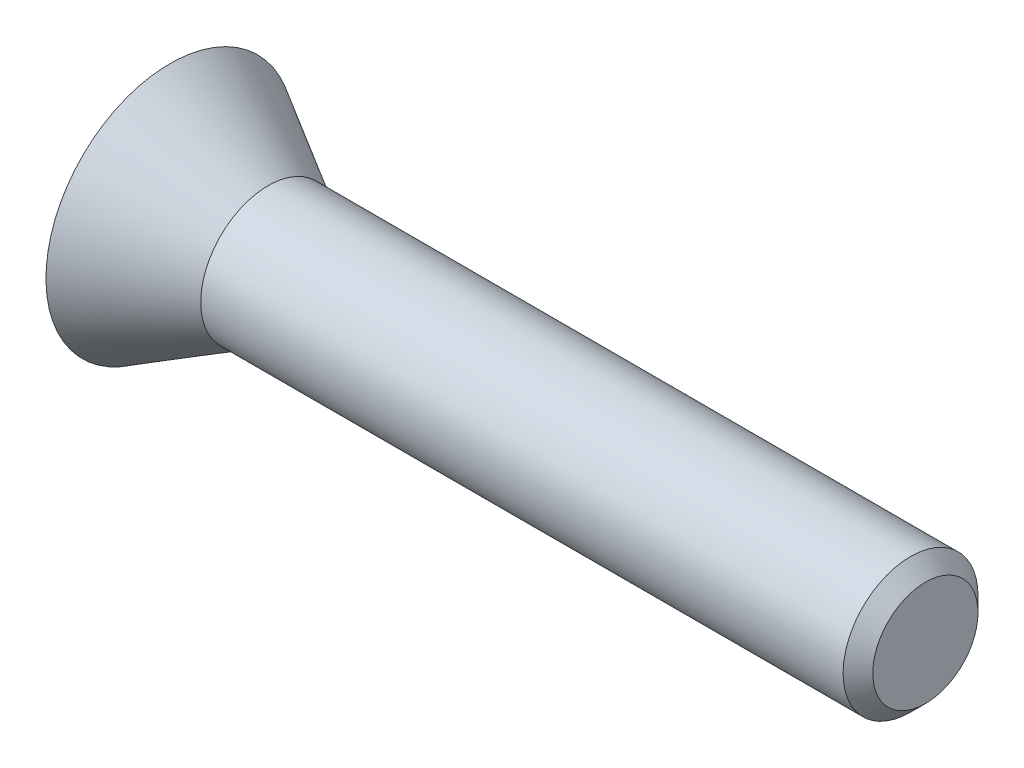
ISO-10303-21;
HEADER;
FILE_DESCRIPTION(('STEP AP214'),'2;1');
FILE_NAME('part.step','',(''),(''),'','','');
FILE_SCHEMA(('AUTOMOTIVE_DESIGN { 1 0 10303 214 1 1 1 1 }'));
ENDSEC;
DATA;
#1=APPLICATION_CONTEXT('core data for automotive mechanical design processes');
#2=APPLICATION_PROTOCOL_DEFINITION('international standard','automotive_design',2000,#1);
#3=PRODUCT_CONTEXT('',#1,'mechanical');
#4=PRODUCT('Part','Part','',(#3));
#5=PRODUCT_RELATED_PRODUCT_CATEGORY('part','',(#4));
#6=PRODUCT_DEFINITION_FORMATION('','',#4);
#7=PRODUCT_DEFINITION_CONTEXT('part definition',#1,'design');
#8=PRODUCT_DEFINITION('design','',#6,#7);
#9=PRODUCT_DEFINITION_SHAPE('','',#8);
#10=(LENGTH_UNIT() NAMED_UNIT(*) SI_UNIT(.MILLI.,.METRE.));
#11=(NAMED_UNIT(*) PLANE_ANGLE_UNIT() SI_UNIT($,.RADIAN.));
#12=(NAMED_UNIT(*) SI_UNIT($,.STERADIAN.) SOLID_ANGLE_UNIT());
#13=UNCERTAINTY_MEASURE_WITH_UNIT(LENGTH_MEASURE(1.E-05),#10,'distance_accuracy_value','');
#14=(GEOMETRIC_REPRESENTATION_CONTEXT(3) GLOBAL_UNCERTAINTY_ASSIGNED_CONTEXT((#13)) GLOBAL_UNIT_ASSIGNED_CONTEXT((#10,
#11,#12)) REPRESENTATION_CONTEXT('',''));
#15=CARTESIAN_POINT('',(0.,0.,0.));
#16=DIRECTION('',(0.,0.,1.));
#17=DIRECTION('',(1.,0.,0.));
#18=AXIS2_PLACEMENT_3D('',#15,#16,#17);
#19=CARTESIAN_POINT('',(-7.,0.,0.));
#20=DIRECTION('',(1.,0.,0.));
#21=DIRECTION('',(0.,0.,-1.));
#22=AXIS2_PLACEMENT_3D('',#19,#20,#21);
#23=PLANE('',#22);
#24=CARTESIAN_POINT('',(-7.,-0.814550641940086,-1.03166904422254));
#25=CARTESIAN_POINT('',(-7.,-0.814409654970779,-1.01863491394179));
#26=CARTESIAN_POINT('',(-7.,-0.81413144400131,-0.992914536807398));
#27=CARTESIAN_POINT('',(-7.,-0.811236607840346,-0.955094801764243));
#28=CARTESIAN_POINT('',(-7.,-0.806397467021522,-0.918608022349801));
#29=CARTESIAN_POINT('',(-7.,-0.799573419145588,-0.88365317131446));
#30=CARTESIAN_POINT('',(-7.,-0.790964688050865,-0.8501336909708));
#31=CARTESIAN_POINT('',(-7.,-0.780789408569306,-0.817906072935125));
#32=CARTESIAN_POINT('',(-7.,-0.768192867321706,-0.787280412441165));
#33=CARTESIAN_POINT('',(-7.,-0.753908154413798,-0.757959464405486));
#34=CARTESIAN_POINT('',(-7.,-0.737740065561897,-0.730356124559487));
#35=CARTESIAN_POINT('',(-7.,-0.719554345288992,-0.704528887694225));
#36=CARTESIAN_POINT('',(-7.,-0.699921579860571,-0.680221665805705));
#37=CARTESIAN_POINT('',(-7.,-0.678448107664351,-0.657618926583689));
#38=CARTESIAN_POINT('',(-7.,-0.65525940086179,-0.636744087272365));
#39=CARTESIAN_POINT('',(-7.,-0.630329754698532,-0.617478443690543));
#40=CARTESIAN_POINT('',(-7.,-0.603500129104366,-0.600217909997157));
#41=CARTESIAN_POINT('',(-7.,-0.575132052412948,-0.584427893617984));
#42=CARTESIAN_POINT('',(-7.,-0.545147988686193,-0.57037959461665));
#43=CARTESIAN_POINT('',(-7.,-0.513404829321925,-0.558522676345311));
#44=CARTESIAN_POINT('',(-7.,-0.480253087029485,-0.54824282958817));
#45=CARTESIAN_POINT('',(-7.,-0.445698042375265,-0.539643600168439));
#46=CARTESIAN_POINT('',(-7.,-0.409582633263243,-0.533059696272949));
#47=CARTESIAN_POINT('',(-7.,-0.371934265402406,-0.528671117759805));
#48=CARTESIAN_POINT('',(-7.,-0.332717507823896,-0.525628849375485));
#49=CARTESIAN_POINT('',(-7.,-0.306045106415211,-0.525377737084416));
#50=CARTESIAN_POINT('',(-7.,-0.29243937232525,-0.525249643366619));
#51=B_SPLINE_CURVE_WITH_KNOTS('',3,(#24,#25,#26,#27,#28,#29,#30,#31,#32,#33,#34,#35,#36,#37,#38,
#39,#40,#41,#42,#43,#44,#45,#46,#47,#48,#49,#50),.UNSPECIFIED.,.F.,.F.,(4,1,1,1,1,1,1,1,1,1,1,1,
1,1,1,1,1,1,1,1,1,1,1,1,4),(0.,0.04725989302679,0.093258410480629,0.137448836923,
0.180669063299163,0.222325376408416,0.262898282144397,0.303117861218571,0.342294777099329,
0.381096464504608,0.418984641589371,0.456742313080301,0.494310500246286,0.531916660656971,
0.569787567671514,0.608434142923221,0.647492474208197,0.687453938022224,0.728384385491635,
0.770272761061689,0.813266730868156,0.85743965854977,0.903297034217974,0.950671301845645,1.),.UNSPECIFIED.);
#52=CARTESIAN_POINT('',(-7.,-0.814550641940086,-1.03166904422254));
#53=VERTEX_POINT('',#52);
#54=CARTESIAN_POINT('',(-7.,-0.29243937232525,-0.525249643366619));
#55=VERTEX_POINT('',#54);
#56=EDGE_CURVE('E255',#53,#55,#51,.T.);
#57=ORIENTED_EDGE('',*,*,#56,.F.);
#58=CARTESIAN_POINT('',(-7.,-0.33095577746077,-1.53323823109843));
#59=CARTESIAN_POINT('',(-7.,-0.355694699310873,-1.52836228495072));
#60=CARTESIAN_POINT('',(-7.,-0.403791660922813,-1.51888255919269));
#61=CARTESIAN_POINT('',(-7.,-0.47228513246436,-1.49757997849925));
#62=CARTESIAN_POINT('',(-7.,-0.535215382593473,-1.4713282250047));
#63=CARTESIAN_POINT('',(-7.,-0.592488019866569,-1.44008717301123));
#64=CARTESIAN_POINT('',(-7.,-0.6435367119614,-1.40366636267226));
#65=CARTESIAN_POINT('',(-7.,-0.688552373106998,-1.36293722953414));
#66=CARTESIAN_POINT('',(-7.,-0.727155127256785,-1.31755558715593));
#67=CARTESIAN_POINT('',(-7.,-0.75895707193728,-1.26761478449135));
#68=CARTESIAN_POINT('',(-7.,-0.783958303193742,-1.21369041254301));
#69=CARTESIAN_POINT('',(-7.,-0.801516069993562,-1.15607758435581));
#70=CARTESIAN_POINT('',(-7.,-0.812875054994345,-1.09507319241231));
#71=CARTESIAN_POINT('',(-7.,-0.813983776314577,-1.05311921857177));
#72=CARTESIAN_POINT('',(-7.,-0.814550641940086,-1.03166904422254));
#73=B_SPLINE_CURVE_WITH_KNOTS('',3,(#58,#59,#60,#61,#62,#63,#64,#65,#66,#67,#68,#69,#70,#71,
#72),.UNSPECIFIED.,.F.,.F.,(4,1,1,1,1,1,1,1,1,1,1,1,4),(0.,0.0988237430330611,0.192131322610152,
0.28071953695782,0.365844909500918,0.447392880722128,0.52606487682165,0.603327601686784,
0.680299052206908,0.757555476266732,0.835645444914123,0.915969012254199,1.),.UNSPECIFIED.);
#74=CARTESIAN_POINT('',(-7.,-0.33095577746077,-1.53323823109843));
#75=VERTEX_POINT('',#74);
#76=EDGE_CURVE('E49',#75,#53,#73,.T.);
#77=ORIENTED_EDGE('',*,*,#76,.F.);
#78=DIRECTION('',(0.,0.,-1.));
#79=VECTOR('',#78,1.);
#80=CARTESIAN_POINT('',(-7.,-0.33095577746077,-1.25991440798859));
#81=LINE('',#80,#79);
#82=CARTESIAN_POINT('',(-7.,-0.33095577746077,-1.25991440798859));
#83=VERTEX_POINT('',#82);
#84=EDGE_CURVE('E186',#83,#75,#81,.T.);
#85=ORIENTED_EDGE('',*,*,#84,.F.);
#86=CARTESIAN_POINT('',(-7.,-0.550641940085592,-1.03166904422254));
#87=CARTESIAN_POINT('',(-7.,-0.550270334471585,-1.0410991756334));
#88=CARTESIAN_POINT('',(-7.,-0.549541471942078,-1.05959531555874));
#89=CARTESIAN_POINT('',(-7.,-0.54507953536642,-1.08661629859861));
#90=CARTESIAN_POINT('',(-7.,-0.536856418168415,-1.11205742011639));
#91=CARTESIAN_POINT('',(-7.,-0.525776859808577,-1.13609037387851));
#92=CARTESIAN_POINT('',(-7.,-0.511462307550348,-1.15853899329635));
#93=CARTESIAN_POINT('',(-7.,-0.493775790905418,-1.178763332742));
#94=CARTESIAN_POINT('',(-7.,-0.47364330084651,-1.19760112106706));
#95=CARTESIAN_POINT('',(-7.,-0.450409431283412,-1.21436735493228));
#96=CARTESIAN_POINT('',(-7.,-0.42440946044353,-1.22922997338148));
#97=CARTESIAN_POINT('',(-7.,-0.395633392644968,-1.24165925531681));
#98=CARTESIAN_POINT('',(-7.,-0.364401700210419,-1.25244828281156));
#99=CARTESIAN_POINT('',(-7.,-0.342332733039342,-1.25737473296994));
#100=CARTESIAN_POINT('',(-7.,-0.33095577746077,-1.25991440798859));
#101=B_SPLINE_CURVE_WITH_KNOTS('',3,(#86,#87,#88,#89,#90,#91,#92,#93,#94,#95,#96,#97,#98,#99,
#100),.UNSPECIFIED.,.F.,.F.,(4,1,1,1,1,1,1,1,1,1,1,1,4),(0.,0.0817564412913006,
0.160356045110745,0.236478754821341,0.312819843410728,0.389192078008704,0.466352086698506,
0.545094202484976,0.627698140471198,0.714093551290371,0.80415108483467,0.89903630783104,1.),.UNSPECIFIED.);
#102=CARTESIAN_POINT('',(-7.,-0.550641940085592,-1.03166904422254));
#103=VERTEX_POINT('',#102);
#104=EDGE_CURVE('E189',#103,#83,#101,.T.);
#105=ORIENTED_EDGE('',*,*,#104,.F.);
#106=CARTESIAN_POINT('',(-7.,-0.29243937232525,-0.798573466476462));
#107=CARTESIAN_POINT('',(-7.,-0.30558072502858,-0.798881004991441));
#108=CARTESIAN_POINT('',(-7.,-0.331019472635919,-0.799476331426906));
#109=CARTESIAN_POINT('',(-7.,-0.367667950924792,-0.804633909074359));
#110=CARTESIAN_POINT('',(-7.,-0.401378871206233,-0.813166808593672));
#111=CARTESIAN_POINT('',(-7.,-0.432094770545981,-0.825005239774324));
#112=CARTESIAN_POINT('',(-7.,-0.459377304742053,-0.840555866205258));
#113=CARTESIAN_POINT('',(-7.,-0.483446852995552,-0.8590233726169));
#114=CARTESIAN_POINT('',(-7.,-0.504245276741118,-0.88051445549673));
#115=CARTESIAN_POINT('',(-7.,-0.521167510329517,-0.905362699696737));
#116=CARTESIAN_POINT('',(-7.,-0.534404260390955,-0.933082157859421));
#117=CARTESIAN_POINT('',(-7.,-0.543708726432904,-0.963566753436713));
#118=CARTESIAN_POINT('',(-7.,-0.54954934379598,-0.996735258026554));
#119=CARTESIAN_POINT('',(-7.,-0.550269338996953,-1.01975579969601));
#120=CARTESIAN_POINT('',(-7.,-0.550641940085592,-1.03166904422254));
#121=B_SPLINE_CURVE_WITH_KNOTS('',3,(#106,#107,#108,#109,#110,#111,#112,#113,#114,#115,#116,
#117,#118,#119,#120),.UNSPECIFIED.,.F.,.F.,(4,1,1,1,1,1,1,1,1,1,1,1,4),(0.,0.0997433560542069,
0.193081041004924,0.28029932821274,0.363302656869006,0.442209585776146,0.517891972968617,
0.592965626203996,0.668275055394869,0.745143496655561,0.825309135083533,0.909596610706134,1.),.UNSPECIFIED.);
#122=CARTESIAN_POINT('',(-7.,-0.29243937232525,-0.798573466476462));
#123=VERTEX_POINT('',#122);
#124=EDGE_CURVE('E348',#123,#103,#121,.T.);
#125=ORIENTED_EDGE('',*,*,#124,.F.);
#126=DIRECTION('',(0.,-1.,0.));
#127=VECTOR('',#126,1.);
#128=CARTESIAN_POINT('',(-7.,0.0915834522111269,-0.798573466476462));
#129=LINE('',#128,#127);
#130=CARTESIAN_POINT('',(-7.,0.091583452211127,-0.798573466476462));
#131=VERTEX_POINT('',#130);
#132=EDGE_CURVE('E356',#131,#123,#129,.T.);
#133=ORIENTED_EDGE('',*,*,#132,.F.);
#134=CARTESIAN_POINT('',(-7.,0.350641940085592,-1.03166904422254));
#135=CARTESIAN_POINT('',(-7.,0.350225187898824,-1.01976468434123));
#136=CARTESIAN_POINT('',(-7.,0.349420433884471,-0.996777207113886));
#137=CARTESIAN_POINT('',(-7.,0.344177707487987,-0.963475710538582));
#138=CARTESIAN_POINT('',(-7.,0.334301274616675,-0.933141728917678));
#139=CARTESIAN_POINT('',(-7.,0.321199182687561,-0.905351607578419));
#140=CARTESIAN_POINT('',(-7.,0.304229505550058,-0.880526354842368));
#141=CARTESIAN_POINT('',(-7.,0.283426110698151,-0.858932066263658));
#142=CARTESIAN_POINT('',(-7.,0.259071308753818,-0.840557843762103));
#143=CARTESIAN_POINT('',(-7.,0.231584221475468,-0.825074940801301));
#144=CARTESIAN_POINT('',(-7.,0.200731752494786,-0.813103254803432));
#145=CARTESIAN_POINT('',(-7.,0.16689455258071,-0.80467981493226));
#146=CARTESIAN_POINT('',(-7.,0.130166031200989,-0.799467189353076));
#147=CARTESIAN_POINT('',(-7.,0.104725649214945,-0.798877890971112));
#148=CARTESIAN_POINT('',(-7.,0.091583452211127,-0.798573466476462));
#149=B_SPLINE_CURVE_WITH_KNOTS('',3,(#134,#135,#136,#137,#138,#139,#140,#141,#142,#143,#144,
#145,#146,#147,#148),.UNSPECIFIED.,.F.,.F.,(4,1,1,1,1,1,1,1,1,1,1,1,4),(0.,0.0902231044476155,
0.174222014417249,0.25444494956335,0.331160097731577,0.406319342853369,0.481243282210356,
0.557346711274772,0.636723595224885,0.719561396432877,0.807304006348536,0.900455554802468,1.),.UNSPECIFIED.);
#150=CARTESIAN_POINT('',(-7.,0.350641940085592,-1.03166904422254));
#151=VERTEX_POINT('',#150);
#152=EDGE_CURVE('E362',#151,#131,#149,.T.);
#153=ORIENTED_EDGE('',*,*,#152,.F.);
#154=CARTESIAN_POINT('',(-7.,0.131241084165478,-1.25991440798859));
#155=CARTESIAN_POINT('',(-7.,0.142424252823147,-1.25715743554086));
#156=CARTESIAN_POINT('',(-7.,0.164185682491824,-1.25179261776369));
#157=CARTESIAN_POINT('',(-7.,0.195143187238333,-1.24074684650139));
#158=CARTESIAN_POINT('',(-7.,0.223818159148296,-1.22818670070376));
#159=CARTESIAN_POINT('',(-7.,0.24952741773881,-1.21282567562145));
#160=CARTESIAN_POINT('',(-7.,0.272891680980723,-1.19610347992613));
#161=CARTESIAN_POINT('',(-7.,0.293133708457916,-1.17724471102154));
#162=CARTESIAN_POINT('',(-7.,0.310589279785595,-1.15666214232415));
#163=CARTESIAN_POINT('',(-7.,0.325026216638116,-1.13451470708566));
#164=CARTESIAN_POINT('',(-7.,0.336792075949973,-1.11086271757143));
#165=CARTESIAN_POINT('',(-7.,0.344578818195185,-1.08559852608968));
#166=CARTESIAN_POINT('',(-7.,0.349663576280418,-1.05907090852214));
#167=CARTESIAN_POINT('',(-7.,0.350311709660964,-1.04091808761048));
#168=CARTESIAN_POINT('',(-7.,0.350641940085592,-1.03166904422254));
#169=B_SPLINE_CURVE_WITH_KNOTS('',3,(#154,#155,#156,#157,#158,#159,#160,#161,#162,#163,#164,
#165,#166,#167,#168),.UNSPECIFIED.,.F.,.F.,(4,1,1,1,1,1,1,1,1,1,1,1,4),(0.,0.100258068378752,
0.195093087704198,0.285925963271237,0.37244127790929,0.455447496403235,0.535743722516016,
0.612742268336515,0.689936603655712,0.765509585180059,0.842003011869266,0.919498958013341,1.),.UNSPECIFIED.);
#170=CARTESIAN_POINT('',(-7.,0.131241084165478,-1.25991440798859));
#171=VERTEX_POINT('',#170);
#172=EDGE_CURVE('E367',#171,#151,#169,.T.);
#173=ORIENTED_EDGE('',*,*,#172,.F.);
#174=DIRECTION('',(0.,0.,1.));
#175=VECTOR('',#174,1.);
#176=CARTESIAN_POINT('',(-7.,0.131241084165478,-1.53323823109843));
#177=LINE('',#176,#175);
#178=CARTESIAN_POINT('',(-7.,0.131241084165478,-1.53323823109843));
#179=VERTEX_POINT('',#178);
#180=EDGE_CURVE('E375',#179,#171,#177,.T.);
#181=ORIENTED_EDGE('',*,*,#180,.F.);
#182=CARTESIAN_POINT('',(-7.,0.614550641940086,-1.03166904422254));
#183=CARTESIAN_POINT('',(-7.,0.613976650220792,-1.05311814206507));
#184=CARTESIAN_POINT('',(-7.,0.612851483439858,-1.09516371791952));
#185=CARTESIAN_POINT('',(-7.,0.601554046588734,-1.15627369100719));
#186=CARTESIAN_POINT('',(-7.,0.583965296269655,-1.21398147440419));
#187=CARTESIAN_POINT('',(-7.,0.558885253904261,-1.26794980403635));
#188=CARTESIAN_POINT('',(-7.,0.527241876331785,-1.31800972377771));
#189=CARTESIAN_POINT('',(-7.,0.48874158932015,-1.36357515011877));
#190=CARTESIAN_POINT('',(-7.,0.443888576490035,-1.4046307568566));
#191=CARTESIAN_POINT('',(-7.,0.392499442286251,-1.44082215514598));
#192=CARTESIAN_POINT('',(-7.,0.335291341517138,-1.47225243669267));
#193=CARTESIAN_POINT('',(-7.,0.272257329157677,-1.49812704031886));
#194=CARTESIAN_POINT('',(-7.,0.203867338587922,-1.51912954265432));
#195=CARTESIAN_POINT('',(-7.,0.155882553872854,-1.52845127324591));
#196=CARTESIAN_POINT('',(-7.,0.131241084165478,-1.53323823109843));
#197=B_SPLINE_CURVE_WITH_KNOTS('',3,(#182,#183,#184,#185,#186,#187,#188,#189,#190,#191,#192,
#193,#194,#195,#196),.UNSPECIFIED.,.F.,.F.,(4,1,1,1,1,1,1,1,1,1,1,1,4),(0.,0.0840057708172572,
0.164672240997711,0.242738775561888,0.319972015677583,0.397234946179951,0.474233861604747,
0.553133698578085,0.634960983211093,0.720060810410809,0.808478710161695,0.901648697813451,1.),.UNSPECIFIED.);
#198=CARTESIAN_POINT('',(-7.,0.614550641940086,-1.03166904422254));
#199=VERTEX_POINT('',#198);
#200=EDGE_CURVE('E381',#199,#179,#197,.T.);
#201=ORIENTED_EDGE('',*,*,#200,.F.);
#202=CARTESIAN_POINT('',(-7.,0.0915834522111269,-0.525249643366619));
#203=CARTESIAN_POINT('',(-7.,0.105189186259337,-0.525377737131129));
#204=CARTESIAN_POINT('',(-7.,0.131861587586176,-0.525628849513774));
#205=CARTESIAN_POINT('',(-7.,0.171078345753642,-0.52867111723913));
#206=CARTESIAN_POINT('',(-7.,0.208726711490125,-0.533059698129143));
#207=CARTESIAN_POINT('',(-7.,0.244842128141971,-0.53964359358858));
#208=CARTESIAN_POINT('',(-7.,0.279397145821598,-0.548242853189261));
#209=CARTESIAN_POINT('',(-7.,0.312548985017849,-0.558522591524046));
#210=CARTESIAN_POINT('',(-7.,0.344291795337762,-0.570379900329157));
#211=CARTESIAN_POINT('',(-7.,0.374277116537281,-0.584426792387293));
#212=CARTESIAN_POINT('',(-7.,0.402640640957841,-0.600221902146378));
#213=CARTESIAN_POINT('',(-7.,0.429486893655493,-0.617463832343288));
#214=CARTESIAN_POINT('',(-7.,0.454411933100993,-0.636840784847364));
#215=CARTESIAN_POINT('',(-7.,0.477873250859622,-0.657517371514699));
#216=CARTESIAN_POINT('',(-7.,0.499340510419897,-0.680234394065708));
#217=CARTESIAN_POINT('',(-7.,0.518980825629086,-0.704528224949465));
#218=CARTESIAN_POINT('',(-7.,0.537191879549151,-0.730345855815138));
#219=CARTESIAN_POINT('',(-7.,0.553269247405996,-0.758039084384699));
#220=CARTESIAN_POINT('',(-7.,0.568001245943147,-0.78719116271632));
#221=CARTESIAN_POINT('',(-7.,0.580398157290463,-0.817975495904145));
#222=CARTESIAN_POINT('',(-7.,0.591060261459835,-0.850070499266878));
#223=CARTESIAN_POINT('',(-7.,0.599544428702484,-0.883662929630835));
#224=CARTESIAN_POINT('',(-7.,0.606405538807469,-0.918605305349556));
#225=CARTESIAN_POINT('',(-7.,0.611234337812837,-0.955095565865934));
#226=CARTESIAN_POINT('',(-7.,0.614132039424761,-0.992914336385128));
#227=CARTESIAN_POINT('',(-7.,0.614409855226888,-1.01863484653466));
#228=CARTESIAN_POINT('',(-7.,0.614550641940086,-1.03166904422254));
#229=B_SPLINE_CURVE_WITH_KNOTS('',3,(#202,#203,#204,#205,#206,#207,#208,#209,#210,#211,#212,
#213,#214,#215,#216,#217,#218,#219,#220,#221,#222,#223,#224,#225,#226,#227,#228),.UNSPECIFIED.,
.F.,.F.,(4,1,1,1,1,1,1,1,1,1,1,1,1,1,1,1,1,1,1,1,1,1,1,1,4),(0.,0.0493032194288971,
0.0966530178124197,0.142486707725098,0.186636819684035,0.229608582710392,0.271475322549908,
0.312384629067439,0.352325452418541,0.391363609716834,0.429990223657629,0.467841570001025,
0.505685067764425,0.543233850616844,0.580972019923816,0.618840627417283,0.657622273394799,
0.696931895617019,0.737130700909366,0.777789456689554,0.819424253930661,0.862622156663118,
0.906789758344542,0.952764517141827,1.),.UNSPECIFIED.);
#230=CARTESIAN_POINT('',(-7.,0.0915834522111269,-0.525249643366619));
#231=VERTEX_POINT('',#230);
#232=EDGE_CURVE('E386',#231,#199,#229,.T.);
#233=ORIENTED_EDGE('',*,*,#232,.F.);
#234=DIRECTION('',(0.,1.,0.));
#235=VECTOR('',#234,1.);
#236=CARTESIAN_POINT('',(-7.,-0.29243937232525,-0.525249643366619));
#237=LINE('',#236,#235);
#238=EDGE_CURVE('E394',#55,#231,#237,.T.);
#239=ORIENTED_EDGE('',*,*,#238,.F.);
#240=EDGE_LOOP('',(#57,#77,#85,#105,#125,#133,#153,#173,#181,#201,#233,#239));
#241=FACE_BOUND('',#240,.T.);
#242=DIRECTION('',(0.,1.,0.));
#243=VECTOR('',#242,1.);
#244=CARTESIAN_POINT('',(-7.,1.01,0.23));
#245=LINE('',#244,#243);
#246=CARTESIAN_POINT('',(-7.,-1.52,0.23));
#247=VERTEX_POINT('',#246);
#248=CARTESIAN_POINT('',(-7.,1.01,0.23));
#249=VERTEX_POINT('',#248);
#250=EDGE_CURVE('E260',#247,#249,#245,.T.);
#251=ORIENTED_EDGE('',*,*,#250,.F.);
#252=CARTESIAN_POINT('',(-7.,-1.52,0.));
#253=DIRECTION('',(-1.,0.,0.));
#254=DIRECTION('',(0.,0.,1.));
#255=AXIS2_PLACEMENT_3D('',#252,#253,#254);
#256=CIRCLE('',#255,0.23);
#257=CARTESIAN_POINT('',(-7.,-1.52,-0.23));
#258=VERTEX_POINT('',#257);
#259=EDGE_CURVE('E57',#258,#247,#256,.T.);
#260=ORIENTED_EDGE('',*,*,#259,.F.);
#261=DIRECTION('',(0.,-1.,0.));
#262=VECTOR('',#261,1.);
#263=CARTESIAN_POINT('',(-7.,1.01,-0.23));
#264=LINE('',#263,#262);
#265=CARTESIAN_POINT('',(-7.,1.01,-0.23));
#266=VERTEX_POINT('',#265);
#267=EDGE_CURVE('E286',#266,#258,#264,.T.);
#268=ORIENTED_EDGE('',*,*,#267,.F.);
#269=DIRECTION('',(0.,0.,1.));
#270=VECTOR('',#269,1.);
#271=CARTESIAN_POINT('',(-7.,1.01,-0.55));
#272=LINE('',#271,#270);
#273=CARTESIAN_POINT('',(-7.,1.01,-0.55));
#274=VERTEX_POINT('',#273);
#275=EDGE_CURVE('E290',#274,#266,#272,.T.);
#276=ORIENTED_EDGE('',*,*,#275,.F.);
#277=DIRECTION('',(0.,-0.858315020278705,-0.513123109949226));
#278=VECTOR('',#277,1.);
#279=CARTESIAN_POINT('',(-7.,1.93,0.));
#280=LINE('',#279,#278);
#281=CARTESIAN_POINT('',(-7.,1.93,0.));
#282=VERTEX_POINT('',#281);
#283=EDGE_CURVE('E293',#282,#274,#280,.T.);
#284=ORIENTED_EDGE('',*,*,#283,.F.);
#285=DIRECTION('',(0.,0.858315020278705,-0.513123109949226));
#286=VECTOR('',#285,1.);
#287=CARTESIAN_POINT('',(-7.,1.93,0.));
#288=LINE('',#287,#286);
#289=CARTESIAN_POINT('',(-7.,1.01,0.55));
#290=VERTEX_POINT('',#289);
#291=EDGE_CURVE('E296',#290,#282,#288,.T.);
#292=ORIENTED_EDGE('',*,*,#291,.F.);
#293=DIRECTION('',(0.,0.,1.));
#294=VECTOR('',#293,1.);
#295=CARTESIAN_POINT('',(-7.,1.01,0.55));
#296=LINE('',#295,#294);
#297=EDGE_CURVE('E299',#249,#290,#296,.T.);
#298=ORIENTED_EDGE('',*,*,#297,.F.);
#299=EDGE_LOOP('',(#251,#260,#268,#276,#284,#292,#298));
#300=FACE_BOUND('',#299,.T.);
#301=CARTESIAN_POINT('',(-7.,0.,0.));
#302=DIRECTION('',(-1.,0.,0.));
#303=DIRECTION('',(0.,-1.,0.));
#304=AXIS2_PLACEMENT_3D('',#301,#302,#303);
#305=CIRCLE('',#304,2.3);
#306=CARTESIAN_POINT('',(-7.,-2.3,0.));
#307=VERTEX_POINT('',#306);
#308=EDGE_CURVE('E263',#307,#307,#305,.T.);
#309=ORIENTED_EDGE('',*,*,#308,.T.);
#310=EDGE_LOOP('',(#309));
#311=FACE_BOUND('',#310,.T.);
#312=ADVANCED_FACE('F34',(#241,#300,#311),#23,.F.);
#313=CARTESIAN_POINT('',(-7.,0.,0.));
#314=DIRECTION('',(-1.,0.,0.));
#315=DIRECTION('',(0.,-1.,0.));
#316=AXIS2_PLACEMENT_3D('',#313,#314,#315);
#317=CONICAL_SURFACE('',#316,2.3,0.523598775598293);
#318=CARTESIAN_POINT('',(-5.18134665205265,0.,0.));
#319=DIRECTION('',(-1.,0.,0.));
#320=DIRECTION('',(0.,-1.,0.));
#321=AXIS2_PLACEMENT_3D('',#318,#319,#320);
#322=CIRCLE('',#321,1.25);
#323=CARTESIAN_POINT('',(-5.18134665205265,-1.25,0.));
#324=VERTEX_POINT('',#323);
#325=EDGE_CURVE('E265',#324,#324,#322,.T.);
#326=ORIENTED_EDGE('',*,*,#325,.T.);
#327=EDGE_LOOP('',(#326));
#328=FACE_BOUND('',#327,.T.);
#329=ORIENTED_EDGE('',*,*,#308,.F.);
#330=EDGE_LOOP('',(#329));
#331=FACE_BOUND('',#330,.T.);
#332=ADVANCED_FACE('F242',(#328,#331),#317,.T.);
#333=CARTESIAN_POINT('',(-7.,0.,0.));
#334=DIRECTION('',(-1.,0.,0.));
#335=DIRECTION('',(0.,-1.,0.));
#336=AXIS2_PLACEMENT_3D('',#333,#334,#335);
#337=CYLINDRICAL_SURFACE('',#336,1.25);
#338=CARTESIAN_POINT('',(6.725,0.,0.));
#339=DIRECTION('',(1.,0.,0.));
#340=DIRECTION('',(0.,1.,0.));
#341=AXIS2_PLACEMENT_3D('',#338,#339,#340);
#342=CIRCLE('',#341,1.25);
#343=CARTESIAN_POINT('',(6.725,1.25,0.));
#344=VERTEX_POINT('',#343);
#345=EDGE_CURVE('E42',#344,#344,#342,.F.);
#346=ORIENTED_EDGE('',*,*,#345,.T.);
#347=EDGE_LOOP('',(#346));
#348=FACE_BOUND('',#347,.T.);
#349=ORIENTED_EDGE('',*,*,#325,.F.);
#350=EDGE_LOOP('',(#349));
#351=FACE_BOUND('',#350,.T.);
#352=ADVANCED_FACE('F239',(#348,#351),#337,.T.);
#353=CARTESIAN_POINT('',(7.,0.,0.));
#354=DIRECTION('',(1.,0.,0.));
#355=DIRECTION('',(0.,0.,-1.));
#356=AXIS2_PLACEMENT_3D('',#353,#354,#355);
#357=PLANE('',#356);
#358=CARTESIAN_POINT('',(7.,0.,0.));
#359=DIRECTION('',(1.,0.,0.));
#360=DIRECTION('',(0.,0.,-1.));
#361=AXIS2_PLACEMENT_3D('',#358,#359,#360);
#362=CIRCLE('',#361,0.975000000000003);
#363=CARTESIAN_POINT('',(7.,0.,-0.975000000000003));
#364=VERTEX_POINT('',#363);
#365=EDGE_CURVE('E11',#364,#364,#362,.T.);
#366=ORIENTED_EDGE('',*,*,#365,.T.);
#367=EDGE_LOOP('',(#366));
#368=FACE_BOUND('',#367,.T.);
#369=ADVANCED_FACE('F238',(#368),#357,.T.);
#370=CARTESIAN_POINT('',(-6.4,-1.52,0.));
#371=DIRECTION('',(-1.,0.,0.));
#372=DIRECTION('',(0.,0.,1.));
#373=AXIS2_PLACEMENT_3D('',#370,#371,#372);
#374=CYLINDRICAL_SURFACE('',#373,0.23);
#375=ORIENTED_EDGE('',*,*,#259,.T.);
#376=DIRECTION('',(-1.,0.,0.));
#377=VECTOR('',#376,1.);
#378=CARTESIAN_POINT('',(-6.4,-1.52,0.23));
#379=LINE('',#378,#377);
#380=CARTESIAN_POINT('',(-6.4,-1.52,0.23));
#381=VERTEX_POINT('',#380);
#382=EDGE_CURVE('E272',#381,#247,#379,.T.);
#383=ORIENTED_EDGE('',*,*,#382,.F.);
#384=CARTESIAN_POINT('',(-6.4,-1.52,0.));
#385=DIRECTION('',(-1.,0.,0.));
#386=DIRECTION('',(0.,0.,1.));
#387=AXIS2_PLACEMENT_3D('',#384,#385,#386);
#388=CIRCLE('',#387,0.23);
#389=CARTESIAN_POINT('',(-6.4,-1.52,-0.23));
#390=VERTEX_POINT('',#389);
#391=EDGE_CURVE('E289',#390,#381,#388,.T.);
#392=ORIENTED_EDGE('',*,*,#391,.F.);
#393=DIRECTION('',(-1.,0.,0.));
#394=VECTOR('',#393,1.);
#395=CARTESIAN_POINT('',(-6.4,-1.52,-0.23));
#396=LINE('',#395,#394);
#397=EDGE_CURVE('E269',#390,#258,#396,.T.);
#398=ORIENTED_EDGE('',*,*,#397,.T.);
#399=EDGE_LOOP('',(#375,#383,#392,#398));
#400=FACE_BOUND('',#399,.T.);
#401=ADVANCED_FACE('F216',(#400),#374,.F.);
#402=CARTESIAN_POINT('',(-6.4,1.01,-0.23));
#403=DIRECTION('',(0.,0.,-1.));
#404=DIRECTION('',(0.,1.,0.));
#405=AXIS2_PLACEMENT_3D('',#402,#403,#404);
#406=PLANE('',#405);
#407=ORIENTED_EDGE('',*,*,#267,.T.);
#408=ORIENTED_EDGE('',*,*,#397,.F.);
#409=DIRECTION('',(0.,-1.,0.));
#410=VECTOR('',#409,1.);
#411=CARTESIAN_POINT('',(-6.4,1.01,-0.23));
#412=LINE('',#411,#410);
#413=CARTESIAN_POINT('',(-6.4,1.01,-0.23));
#414=VERTEX_POINT('',#413);
#415=EDGE_CURVE('E275',#414,#390,#412,.T.);
#416=ORIENTED_EDGE('',*,*,#415,.F.);
#417=DIRECTION('',(-1.,0.,0.));
#418=VECTOR('',#417,1.);
#419=CARTESIAN_POINT('',(-6.4,1.01,-0.23));
#420=LINE('',#419,#418);
#421=EDGE_CURVE('E283',#414,#266,#420,.T.);
#422=ORIENTED_EDGE('',*,*,#421,.T.);
#423=EDGE_LOOP('',(#407,#408,#416,#422));
#424=FACE_BOUND('',#423,.T.);
#425=ADVANCED_FACE('F212',(#424),#406,.F.);
#426=CARTESIAN_POINT('',(-6.4,1.01,-0.55));
#427=DIRECTION('',(0.,-1.,0.));
#428=DIRECTION('',(0.,0.,-1.));
#429=AXIS2_PLACEMENT_3D('',#426,#427,#428);
#430=PLANE('',#429);
#431=ORIENTED_EDGE('',*,*,#275,.T.);
#432=ORIENTED_EDGE('',*,*,#421,.F.);
#433=DIRECTION('',(0.,0.,1.));
#434=VECTOR('',#433,1.);
#435=CARTESIAN_POINT('',(-6.4,1.01,-0.55));
#436=LINE('',#435,#434);
#437=CARTESIAN_POINT('',(-6.4,1.01,-0.55));
#438=VERTEX_POINT('',#437);
#439=EDGE_CURVE('E307',#438,#414,#436,.T.);
#440=ORIENTED_EDGE('',*,*,#439,.F.);
#441=DIRECTION('',(-1.,0.,0.));
#442=VECTOR('',#441,1.);
#443=CARTESIAN_POINT('',(-6.4,1.01,-0.55));
#444=LINE('',#443,#442);
#445=EDGE_CURVE('E281',#438,#274,#444,.T.);
#446=ORIENTED_EDGE('',*,*,#445,.T.);
#447=EDGE_LOOP('',(#431,#432,#440,#446));
#448=FACE_BOUND('',#447,.T.);
#449=ADVANCED_FACE('F215',(#448),#430,.F.);
#450=CARTESIAN_POINT('',(-6.4,1.93,0.));
#451=DIRECTION('',(0.,0.513123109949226,-0.858315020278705));
#452=DIRECTION('',(0.,0.858315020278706,0.513123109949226));
#453=AXIS2_PLACEMENT_3D('',#450,#451,#452);
#454=PLANE('',#453);
#455=ORIENTED_EDGE('',*,*,#283,.T.);
#456=ORIENTED_EDGE('',*,*,#445,.F.);
#457=DIRECTION('',(0.,-0.858315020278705,-0.513123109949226));
#458=VECTOR('',#457,1.);
#459=CARTESIAN_POINT('',(-6.4,1.93,0.));
#460=LINE('',#459,#458);
#461=CARTESIAN_POINT('',(-6.4,1.93,0.));
#462=VERTEX_POINT('',#461);
#463=EDGE_CURVE('E310',#462,#438,#460,.T.);
#464=ORIENTED_EDGE('',*,*,#463,.F.);
#465=DIRECTION('',(-1.,0.,0.));
#466=VECTOR('',#465,1.);
#467=CARTESIAN_POINT('',(-6.4,1.93,0.));
#468=LINE('',#467,#466);
#469=EDGE_CURVE('E279',#462,#282,#468,.T.);
#470=ORIENTED_EDGE('',*,*,#469,.T.);
#471=EDGE_LOOP('',(#455,#456,#464,#470));
#472=FACE_BOUND('',#471,.T.);
#473=ADVANCED_FACE('F220',(#472),#454,.F.);
#474=CARTESIAN_POINT('',(-6.4,1.93,0.));
#475=DIRECTION('',(0.,0.513123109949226,0.858315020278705));
#476=DIRECTION('',(0.,-0.858315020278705,0.513123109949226));
#477=AXIS2_PLACEMENT_3D('',#474,#475,#476);
#478=PLANE('',#477);
#479=ORIENTED_EDGE('',*,*,#291,.T.);
#480=ORIENTED_EDGE('',*,*,#469,.F.);
#481=DIRECTION('',(0.,0.858315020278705,-0.513123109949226));
#482=VECTOR('',#481,1.);
#483=CARTESIAN_POINT('',(-6.4,1.93,0.));
#484=LINE('',#483,#482);
#485=CARTESIAN_POINT('',(-6.4,1.01,0.55));
#486=VERTEX_POINT('',#485);
#487=EDGE_CURVE('E313',#486,#462,#484,.T.);
#488=ORIENTED_EDGE('',*,*,#487,.F.);
#489=DIRECTION('',(-1.,0.,0.));
#490=VECTOR('',#489,1.);
#491=CARTESIAN_POINT('',(-6.4,1.01,0.55));
#492=LINE('',#491,#490);
#493=EDGE_CURVE('E277',#486,#290,#492,.T.);
#494=ORIENTED_EDGE('',*,*,#493,.T.);
#495=EDGE_LOOP('',(#479,#480,#488,#494));
#496=FACE_BOUND('',#495,.T.);
#497=ADVANCED_FACE('F224',(#496),#478,.F.);
#498=CARTESIAN_POINT('',(-6.4,1.01,0.55));
#499=DIRECTION('',(0.,-1.,0.));
#500=DIRECTION('',(0.,0.,-1.));
#501=AXIS2_PLACEMENT_3D('',#498,#499,#500);
#502=PLANE('',#501);
#503=ORIENTED_EDGE('',*,*,#297,.T.);
#504=ORIENTED_EDGE('',*,*,#493,.F.);
#505=DIRECTION('',(0.,0.,1.));
#506=VECTOR('',#505,1.);
#507=CARTESIAN_POINT('',(-6.4,1.01,0.55));
#508=LINE('',#507,#506);
#509=CARTESIAN_POINT('',(-6.4,1.01,0.23));
#510=VERTEX_POINT('',#509);
#511=EDGE_CURVE('E316',#510,#486,#508,.T.);
#512=ORIENTED_EDGE('',*,*,#511,.F.);
#513=DIRECTION('',(-1.,0.,0.));
#514=VECTOR('',#513,1.);
#515=CARTESIAN_POINT('',(-6.4,1.01,0.23));
#516=LINE('',#515,#514);
#517=EDGE_CURVE('E274',#510,#249,#516,.T.);
#518=ORIENTED_EDGE('',*,*,#517,.T.);
#519=EDGE_LOOP('',(#503,#504,#512,#518));
#520=FACE_BOUND('',#519,.T.);
#521=ADVANCED_FACE('F228',(#520),#502,.F.);
#522=CARTESIAN_POINT('',(-6.4,1.01,0.23));
#523=DIRECTION('',(0.,0.,1.));
#524=DIRECTION('',(0.,-1.,0.));
#525=AXIS2_PLACEMENT_3D('',#522,#523,#524);
#526=PLANE('',#525);
#527=ORIENTED_EDGE('',*,*,#250,.T.);
#528=ORIENTED_EDGE('',*,*,#517,.F.);
#529=DIRECTION('',(0.,1.,0.));
#530=VECTOR('',#529,1.);
#531=CARTESIAN_POINT('',(-6.4,1.01,0.23));
#532=LINE('',#531,#530);
#533=EDGE_CURVE('E319',#381,#510,#532,.T.);
#534=ORIENTED_EDGE('',*,*,#533,.F.);
#535=ORIENTED_EDGE('',*,*,#382,.T.);
#536=EDGE_LOOP('',(#527,#528,#534,#535));
#537=FACE_BOUND('',#536,.T.);
#538=ADVANCED_FACE('F210',(#537),#526,.F.);
#539=CARTESIAN_POINT('',(-6.4,-1.52,0.));
#540=DIRECTION('',(-1.,0.,0.));
#541=DIRECTION('',(0.,0.,1.));
#542=AXIS2_PLACEMENT_3D('',#539,#540,#541);
#543=PLANE('',#542);
#544=ORIENTED_EDGE('',*,*,#391,.T.);
#545=ORIENTED_EDGE('',*,*,#533,.T.);
#546=ORIENTED_EDGE('',*,*,#511,.T.);
#547=ORIENTED_EDGE('',*,*,#487,.T.);
#548=ORIENTED_EDGE('',*,*,#463,.T.);
#549=ORIENTED_EDGE('',*,*,#439,.T.);
#550=ORIENTED_EDGE('',*,*,#415,.T.);
#551=EDGE_LOOP('',(#544,#545,#546,#547,#548,#549,#550));
#552=FACE_BOUND('',#551,.T.);
#553=ADVANCED_FACE('F207',(#552),#543,.T.);
#554=CARTESIAN_POINT('',(6.725,0.,0.));
#555=DIRECTION('',(-1.,0.,0.));
#556=DIRECTION('',(0.,-1.,0.));
#557=AXIS2_PLACEMENT_3D('',#554,#555,#556);
#558=CONICAL_SURFACE('',#557,1.25,0.785398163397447);
#559=ORIENTED_EDGE('',*,*,#365,.F.);
#560=EDGE_LOOP('',(#559));
#561=FACE_BOUND('',#560,.T.);
#562=ORIENTED_EDGE('',*,*,#345,.F.);
#563=EDGE_LOOP('',(#562));
#564=FACE_BOUND('',#563,.T.);
#565=ADVANCED_FACE('F36',(#561,#564),#558,.T.);
#566=CARTESIAN_POINT('',(-6.4,-0.33095577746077,-1.53323823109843));
#567=CARTESIAN_POINT('',(-6.4,-0.355694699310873,-1.52836228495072));
#568=CARTESIAN_POINT('',(-6.4,-0.403791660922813,-1.51888255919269));
#569=CARTESIAN_POINT('',(-6.4,-0.47228513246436,-1.49757997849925));
#570=CARTESIAN_POINT('',(-6.4,-0.535215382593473,-1.4713282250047));
#571=CARTESIAN_POINT('',(-6.4,-0.592488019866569,-1.44008717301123));
#572=CARTESIAN_POINT('',(-6.4,-0.6435367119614,-1.40366636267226));
#573=CARTESIAN_POINT('',(-6.4,-0.688552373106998,-1.36293722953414));
#574=CARTESIAN_POINT('',(-6.4,-0.727155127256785,-1.31755558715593));
#575=CARTESIAN_POINT('',(-6.4,-0.75895707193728,-1.26761478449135));
#576=CARTESIAN_POINT('',(-6.4,-0.783958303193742,-1.21369041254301));
#577=CARTESIAN_POINT('',(-6.4,-0.801516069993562,-1.15607758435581));
#578=CARTESIAN_POINT('',(-6.4,-0.812875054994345,-1.09507319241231));
#579=CARTESIAN_POINT('',(-6.4,-0.813983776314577,-1.05311921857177));
#580=CARTESIAN_POINT('',(-6.4,-0.814550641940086,-1.03166904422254));
#581=B_SPLINE_CURVE_WITH_KNOTS('',3,(#566,#567,#568,#569,#570,#571,#572,#573,#574,#575,#576,
#577,#578,#579,#580),.UNSPECIFIED.,.F.,.F.,(4,1,1,1,1,1,1,1,1,1,1,1,4),(0.,0.0988237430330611,
0.192131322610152,0.28071953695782,0.365844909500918,0.447392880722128,0.52606487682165,
0.603327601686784,0.680299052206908,0.757555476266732,0.835645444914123,0.915969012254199,1.),.UNSPECIFIED.);
#582=DIRECTION('',(-1.,0.,0.));
#583=VECTOR('',#582,1.);
#584=SURFACE_OF_LINEAR_EXTRUSION('',#581,#583);
#585=ORIENTED_EDGE('',*,*,#76,.T.);
#586=DIRECTION('',(-1.,0.,0.));
#587=VECTOR('',#586,1.);
#588=CARTESIAN_POINT('',(-6.4,-0.814550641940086,-1.03166904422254));
#589=LINE('',#588,#587);
#590=CARTESIAN_POINT('',(-6.4,-0.814550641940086,-1.03166904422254));
#591=VERTEX_POINT('',#590);
#592=EDGE_CURVE('E163',#591,#53,#589,.T.);
#593=ORIENTED_EDGE('',*,*,#592,.F.);
#594=CARTESIAN_POINT('',(-6.4,-0.33095577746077,-1.53323823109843));
#595=VERTEX_POINT('',#594);
#596=EDGE_CURVE('E167',#595,#591,#581,.T.);
#597=ORIENTED_EDGE('',*,*,#596,.F.);
#598=DIRECTION('',(-1.,0.,0.));
#599=VECTOR('',#598,1.);
#600=CARTESIAN_POINT('',(-6.4,-0.33095577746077,-1.53323823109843));
#601=LINE('',#600,#599);
#602=EDGE_CURVE('E304',#595,#75,#601,.T.);
#603=ORIENTED_EDGE('',*,*,#602,.T.);
#604=EDGE_LOOP('',(#585,#593,#597,#603));
#605=FACE_BOUND('',#604,.T.);
#606=ADVANCED_FACE('F165',(#605),#584,.F.);
#607=CARTESIAN_POINT('',(-6.4,-0.33095577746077,-1.25991440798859));
#608=DIRECTION('',(0.,1.,0.));
#609=DIRECTION('',(0.,0.,1.));
#610=AXIS2_PLACEMENT_3D('',#607,#608,#609);
#611=PLANE('',#610);
#612=ORIENTED_EDGE('',*,*,#84,.T.);
#613=ORIENTED_EDGE('',*,*,#602,.F.);
#614=DIRECTION('',(0.,0.,-1.));
#615=VECTOR('',#614,1.);
#616=CARTESIAN_POINT('',(-6.4,-0.33095577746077,-1.25991440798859));
#617=LINE('',#616,#615);
#618=CARTESIAN_POINT('',(-6.4,-0.33095577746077,-1.25991440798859));
#619=VERTEX_POINT('',#618);
#620=EDGE_CURVE('E173',#619,#595,#617,.T.);
#621=ORIENTED_EDGE('',*,*,#620,.F.);
#622=DIRECTION('',(-1.,0.,0.));
#623=VECTOR('',#622,1.);
#624=CARTESIAN_POINT('',(-6.4,-0.33095577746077,-1.25991440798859));
#625=LINE('',#624,#623);
#626=EDGE_CURVE('E341',#619,#83,#625,.T.);
#627=ORIENTED_EDGE('',*,*,#626,.T.);
#628=EDGE_LOOP('',(#612,#613,#621,#627));
#629=FACE_BOUND('',#628,.T.);
#630=ADVANCED_FACE('F205',(#629),#611,.F.);
#631=CARTESIAN_POINT('',(-6.4,-0.550641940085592,-1.03166904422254));
#632=CARTESIAN_POINT('',(-6.4,-0.550270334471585,-1.0410991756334));
#633=CARTESIAN_POINT('',(-6.4,-0.549541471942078,-1.05959531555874));
#634=CARTESIAN_POINT('',(-6.4,-0.54507953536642,-1.08661629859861));
#635=CARTESIAN_POINT('',(-6.4,-0.536856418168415,-1.11205742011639));
#636=CARTESIAN_POINT('',(-6.4,-0.525776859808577,-1.13609037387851));
#637=CARTESIAN_POINT('',(-6.4,-0.511462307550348,-1.15853899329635));
#638=CARTESIAN_POINT('',(-6.4,-0.493775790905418,-1.178763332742));
#639=CARTESIAN_POINT('',(-6.4,-0.47364330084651,-1.19760112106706));
#640=CARTESIAN_POINT('',(-6.4,-0.450409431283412,-1.21436735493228));
#641=CARTESIAN_POINT('',(-6.4,-0.42440946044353,-1.22922997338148));
#642=CARTESIAN_POINT('',(-6.4,-0.395633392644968,-1.24165925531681));
#643=CARTESIAN_POINT('',(-6.4,-0.364401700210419,-1.25244828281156));
#644=CARTESIAN_POINT('',(-6.4,-0.342332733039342,-1.25737473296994));
#645=CARTESIAN_POINT('',(-6.4,-0.33095577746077,-1.25991440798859));
#646=B_SPLINE_CURVE_WITH_KNOTS('',3,(#631,#632,#633,#634,#635,#636,#637,#638,#639,#640,#641,
#642,#643,#644,#645),.UNSPECIFIED.,.F.,.F.,(4,1,1,1,1,1,1,1,1,1,1,1,4),(0.,0.0817564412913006,
0.160356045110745,0.236478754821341,0.312819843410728,0.389192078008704,0.466352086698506,
0.545094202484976,0.627698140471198,0.714093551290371,0.80415108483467,0.89903630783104,1.),.UNSPECIFIED.);
#647=DIRECTION('',(-1.,0.,0.));
#648=VECTOR('',#647,1.);
#649=SURFACE_OF_LINEAR_EXTRUSION('',#646,#648);
#650=ORIENTED_EDGE('',*,*,#104,.T.);
#651=ORIENTED_EDGE('',*,*,#626,.F.);
#652=CARTESIAN_POINT('',(-6.4,-0.550641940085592,-1.03166904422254));
#653=VERTEX_POINT('',#652);
#654=EDGE_CURVE('E413',#653,#619,#646,.T.);
#655=ORIENTED_EDGE('',*,*,#654,.F.);
#656=DIRECTION('',(-1.,0.,0.));
#657=VECTOR('',#656,1.);
#658=CARTESIAN_POINT('',(-6.4,-0.550641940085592,-1.03166904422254));
#659=LINE('',#658,#657);
#660=EDGE_CURVE('E339',#653,#103,#659,.T.);
#661=ORIENTED_EDGE('',*,*,#660,.T.);
#662=EDGE_LOOP('',(#650,#651,#655,#661));
#663=FACE_BOUND('',#662,.T.);
#664=ADVANCED_FACE('F427',(#663),#649,.F.);
#665=CARTESIAN_POINT('',(-6.4,-0.29243937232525,-0.798573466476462));
#666=CARTESIAN_POINT('',(-6.4,-0.30558072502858,-0.798881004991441));
#667=CARTESIAN_POINT('',(-6.4,-0.331019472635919,-0.799476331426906));
#668=CARTESIAN_POINT('',(-6.4,-0.367667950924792,-0.804633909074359));
#669=CARTESIAN_POINT('',(-6.4,-0.401378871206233,-0.813166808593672));
#670=CARTESIAN_POINT('',(-6.4,-0.432094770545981,-0.825005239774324));
#671=CARTESIAN_POINT('',(-6.4,-0.459377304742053,-0.840555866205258));
#672=CARTESIAN_POINT('',(-6.4,-0.483446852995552,-0.8590233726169));
#673=CARTESIAN_POINT('',(-6.4,-0.504245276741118,-0.88051445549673));
#674=CARTESIAN_POINT('',(-6.4,-0.521167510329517,-0.905362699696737));
#675=CARTESIAN_POINT('',(-6.4,-0.534404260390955,-0.933082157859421));
#676=CARTESIAN_POINT('',(-6.4,-0.543708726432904,-0.963566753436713));
#677=CARTESIAN_POINT('',(-6.4,-0.54954934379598,-0.996735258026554));
#678=CARTESIAN_POINT('',(-6.4,-0.550269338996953,-1.01975579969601));
#679=CARTESIAN_POINT('',(-6.4,-0.550641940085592,-1.03166904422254));
#680=B_SPLINE_CURVE_WITH_KNOTS('',3,(#665,#666,#667,#668,#669,#670,#671,#672,#673,#674,#675,
#676,#677,#678,#679),.UNSPECIFIED.,.F.,.F.,(4,1,1,1,1,1,1,1,1,1,1,1,4),(0.,0.0997433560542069,
0.193081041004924,0.28029932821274,0.363302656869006,0.442209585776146,0.517891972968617,
0.592965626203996,0.668275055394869,0.745143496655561,0.825309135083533,0.909596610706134,1.),.UNSPECIFIED.);
#681=DIRECTION('',(-1.,0.,0.));
#682=VECTOR('',#681,1.);
#683=SURFACE_OF_LINEAR_EXTRUSION('',#680,#682);
#684=ORIENTED_EDGE('',*,*,#124,.T.);
#685=ORIENTED_EDGE('',*,*,#660,.F.);
#686=CARTESIAN_POINT('',(-6.4,-0.29243937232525,-0.798573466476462));
#687=VERTEX_POINT('',#686);
#688=EDGE_CURVE('E418',#687,#653,#680,.T.);
#689=ORIENTED_EDGE('',*,*,#688,.F.);
#690=DIRECTION('',(-1.,0.,0.));
#691=VECTOR('',#690,1.);
#692=CARTESIAN_POINT('',(-6.4,-0.29243937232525,-0.798573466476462));
#693=LINE('',#692,#691);
#694=EDGE_CURVE('E337',#687,#123,#693,.T.);
#695=ORIENTED_EDGE('',*,*,#694,.T.);
#696=EDGE_LOOP('',(#684,#685,#689,#695));
#697=FACE_BOUND('',#696,.T.);
#698=ADVANCED_FACE('F431',(#697),#683,.F.);
#699=CARTESIAN_POINT('',(-6.4,0.0915834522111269,-0.798573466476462));
#700=DIRECTION('',(0.,0.,-1.));
#701=DIRECTION('',(-1.,0.,0.));
#702=AXIS2_PLACEMENT_3D('',#699,#700,#701);
#703=PLANE('',#702);
#704=ORIENTED_EDGE('',*,*,#132,.T.);
#705=ORIENTED_EDGE('',*,*,#694,.F.);
#706=DIRECTION('',(0.,-1.,0.));
#707=VECTOR('',#706,1.);
#708=CARTESIAN_POINT('',(-6.4,0.0915834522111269,-0.798573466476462));
#709=LINE('',#708,#707);
#710=CARTESIAN_POINT('',(-6.4,0.091583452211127,-0.798573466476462));
#711=VERTEX_POINT('',#710);
#712=EDGE_CURVE('E454',#711,#687,#709,.T.);
#713=ORIENTED_EDGE('',*,*,#712,.F.);
#714=DIRECTION('',(-1.,0.,0.));
#715=VECTOR('',#714,1.);
#716=CARTESIAN_POINT('',(-6.4,0.091583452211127,-0.798573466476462));
#717=LINE('',#716,#715);
#718=EDGE_CURVE('E335',#711,#131,#717,.T.);
#719=ORIENTED_EDGE('',*,*,#718,.T.);
#720=EDGE_LOOP('',(#704,#705,#713,#719));
#721=FACE_BOUND('',#720,.T.);
#722=ADVANCED_FACE('F436',(#721),#703,.F.);
#723=CARTESIAN_POINT('',(-6.4,0.350641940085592,-1.03166904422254));
#724=CARTESIAN_POINT('',(-6.4,0.350225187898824,-1.01976468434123));
#725=CARTESIAN_POINT('',(-6.4,0.349420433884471,-0.996777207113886));
#726=CARTESIAN_POINT('',(-6.4,0.344177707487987,-0.963475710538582));
#727=CARTESIAN_POINT('',(-6.4,0.334301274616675,-0.933141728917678));
#728=CARTESIAN_POINT('',(-6.4,0.321199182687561,-0.905351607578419));
#729=CARTESIAN_POINT('',(-6.4,0.304229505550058,-0.880526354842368));
#730=CARTESIAN_POINT('',(-6.4,0.283426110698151,-0.858932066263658));
#731=CARTESIAN_POINT('',(-6.4,0.259071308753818,-0.840557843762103));
#732=CARTESIAN_POINT('',(-6.4,0.231584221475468,-0.825074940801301));
#733=CARTESIAN_POINT('',(-6.4,0.200731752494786,-0.813103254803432));
#734=CARTESIAN_POINT('',(-6.4,0.16689455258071,-0.80467981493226));
#735=CARTESIAN_POINT('',(-6.4,0.130166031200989,-0.799467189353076));
#736=CARTESIAN_POINT('',(-6.4,0.104725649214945,-0.798877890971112));
#737=CARTESIAN_POINT('',(-6.4,0.091583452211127,-0.798573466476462));
#738=B_SPLINE_CURVE_WITH_KNOTS('',3,(#723,#724,#725,#726,#727,#728,#729,#730,#731,#732,#733,
#734,#735,#736,#737),.UNSPECIFIED.,.F.,.F.,(4,1,1,1,1,1,1,1,1,1,1,1,4),(0.,0.0902231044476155,
0.174222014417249,0.25444494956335,0.331160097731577,0.406319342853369,0.481243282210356,
0.557346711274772,0.636723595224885,0.719561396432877,0.807304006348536,0.900455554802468,1.),.UNSPECIFIED.);
#739=DIRECTION('',(-1.,0.,0.));
#740=VECTOR('',#739,1.);
#741=SURFACE_OF_LINEAR_EXTRUSION('',#738,#740);
#742=ORIENTED_EDGE('',*,*,#152,.T.);
#743=ORIENTED_EDGE('',*,*,#718,.F.);
#744=CARTESIAN_POINT('',(-6.4,0.350641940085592,-1.03166904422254));
#745=VERTEX_POINT('',#744);
#746=EDGE_CURVE('E449',#745,#711,#738,.T.);
#747=ORIENTED_EDGE('',*,*,#746,.F.);
#748=DIRECTION('',(-1.,0.,0.));
#749=VECTOR('',#748,1.);
#750=CARTESIAN_POINT('',(-6.4,0.350641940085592,-1.03166904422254));
#751=LINE('',#750,#749);
#752=EDGE_CURVE('E333',#745,#151,#751,.T.);
#753=ORIENTED_EDGE('',*,*,#752,.T.);
#754=EDGE_LOOP('',(#742,#743,#747,#753));
#755=FACE_BOUND('',#754,.T.);
#756=ADVANCED_FACE('F440',(#755),#741,.F.);
#757=CARTESIAN_POINT('',(-6.4,0.131241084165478,-1.25991440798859));
#758=CARTESIAN_POINT('',(-6.4,0.142424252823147,-1.25715743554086));
#759=CARTESIAN_POINT('',(-6.4,0.164185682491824,-1.25179261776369));
#760=CARTESIAN_POINT('',(-6.4,0.195143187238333,-1.24074684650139));
#761=CARTESIAN_POINT('',(-6.4,0.223818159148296,-1.22818670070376));
#762=CARTESIAN_POINT('',(-6.4,0.24952741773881,-1.21282567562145));
#763=CARTESIAN_POINT('',(-6.4,0.272891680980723,-1.19610347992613));
#764=CARTESIAN_POINT('',(-6.4,0.293133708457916,-1.17724471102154));
#765=CARTESIAN_POINT('',(-6.4,0.310589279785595,-1.15666214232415));
#766=CARTESIAN_POINT('',(-6.4,0.325026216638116,-1.13451470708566));
#767=CARTESIAN_POINT('',(-6.4,0.336792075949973,-1.11086271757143));
#768=CARTESIAN_POINT('',(-6.4,0.344578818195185,-1.08559852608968));
#769=CARTESIAN_POINT('',(-6.4,0.349663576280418,-1.05907090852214));
#770=CARTESIAN_POINT('',(-6.4,0.350311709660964,-1.04091808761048));
#771=CARTESIAN_POINT('',(-6.4,0.350641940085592,-1.03166904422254));
#772=B_SPLINE_CURVE_WITH_KNOTS('',3,(#757,#758,#759,#760,#761,#762,#763,#764,#765,#766,#767,
#768,#769,#770,#771),.UNSPECIFIED.,.F.,.F.,(4,1,1,1,1,1,1,1,1,1,1,1,4),(0.,0.100258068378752,
0.195093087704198,0.285925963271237,0.37244127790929,0.455447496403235,0.535743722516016,
0.612742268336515,0.689936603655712,0.765509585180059,0.842003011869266,0.919498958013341,1.),.UNSPECIFIED.);
#773=DIRECTION('',(-1.,0.,0.));
#774=VECTOR('',#773,1.);
#775=SURFACE_OF_LINEAR_EXTRUSION('',#772,#774);
#776=ORIENTED_EDGE('',*,*,#172,.T.);
#777=ORIENTED_EDGE('',*,*,#752,.F.);
#778=CARTESIAN_POINT('',(-6.4,0.131241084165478,-1.25991440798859));
#779=VERTEX_POINT('',#778);
#780=EDGE_CURVE('E455',#779,#745,#772,.T.);
#781=ORIENTED_EDGE('',*,*,#780,.F.);
#782=DIRECTION('',(-1.,0.,0.));
#783=VECTOR('',#782,1.);
#784=CARTESIAN_POINT('',(-6.4,0.131241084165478,-1.25991440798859));
#785=LINE('',#784,#783);
#786=EDGE_CURVE('E331',#779,#171,#785,.T.);
#787=ORIENTED_EDGE('',*,*,#786,.T.);
#788=EDGE_LOOP('',(#776,#777,#781,#787));
#789=FACE_BOUND('',#788,.T.);
#790=ADVANCED_FACE('F445',(#789),#775,.F.);
#791=CARTESIAN_POINT('',(-6.4,0.131241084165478,-1.53323823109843));
#792=DIRECTION('',(0.,-1.,0.));
#793=DIRECTION('',(0.,0.,-1.));
#794=AXIS2_PLACEMENT_3D('',#791,#792,#793);
#795=PLANE('',#794);
#796=ORIENTED_EDGE('',*,*,#180,.T.);
#797=ORIENTED_EDGE('',*,*,#786,.F.);
#798=DIRECTION('',(0.,0.,1.));
#799=VECTOR('',#798,1.);
#800=CARTESIAN_POINT('',(-6.4,0.131241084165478,-1.53323823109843));
#801=LINE('',#800,#799);
#802=CARTESIAN_POINT('',(-6.4,0.131241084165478,-1.53323823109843));
#803=VERTEX_POINT('',#802);
#804=EDGE_CURVE('E486',#803,#779,#801,.T.);
#805=ORIENTED_EDGE('',*,*,#804,.F.);
#806=DIRECTION('',(-1.,0.,0.));
#807=VECTOR('',#806,1.);
#808=CARTESIAN_POINT('',(-6.4,0.131241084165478,-1.53323823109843));
#809=LINE('',#808,#807);
#810=EDGE_CURVE('E329',#803,#179,#809,.T.);
#811=ORIENTED_EDGE('',*,*,#810,.T.);
#812=EDGE_LOOP('',(#796,#797,#805,#811));
#813=FACE_BOUND('',#812,.T.);
#814=ADVANCED_FACE('F483',(#813),#795,.F.);
#815=CARTESIAN_POINT('',(-6.4,0.614550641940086,-1.03166904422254));
#816=CARTESIAN_POINT('',(-6.4,0.613976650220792,-1.05311814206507));
#817=CARTESIAN_POINT('',(-6.4,0.612851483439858,-1.09516371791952));
#818=CARTESIAN_POINT('',(-6.4,0.601554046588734,-1.15627369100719));
#819=CARTESIAN_POINT('',(-6.4,0.583965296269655,-1.21398147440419));
#820=CARTESIAN_POINT('',(-6.4,0.558885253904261,-1.26794980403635));
#821=CARTESIAN_POINT('',(-6.4,0.527241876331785,-1.31800972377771));
#822=CARTESIAN_POINT('',(-6.4,0.48874158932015,-1.36357515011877));
#823=CARTESIAN_POINT('',(-6.4,0.443888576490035,-1.4046307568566));
#824=CARTESIAN_POINT('',(-6.4,0.392499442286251,-1.44082215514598));
#825=CARTESIAN_POINT('',(-6.4,0.335291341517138,-1.47225243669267));
#826=CARTESIAN_POINT('',(-6.4,0.272257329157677,-1.49812704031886));
#827=CARTESIAN_POINT('',(-6.4,0.203867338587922,-1.51912954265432));
#828=CARTESIAN_POINT('',(-6.4,0.155882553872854,-1.52845127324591));
#829=CARTESIAN_POINT('',(-6.4,0.131241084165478,-1.53323823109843));
#830=B_SPLINE_CURVE_WITH_KNOTS('',3,(#815,#816,#817,#818,#819,#820,#821,#822,#823,#824,#825,
#826,#827,#828,#829),.UNSPECIFIED.,.F.,.F.,(4,1,1,1,1,1,1,1,1,1,1,1,4),(0.,0.0840057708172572,
0.164672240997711,0.242738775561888,0.319972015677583,0.397234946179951,0.474233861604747,
0.553133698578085,0.634960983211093,0.720060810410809,0.808478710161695,0.901648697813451,1.),.UNSPECIFIED.);
#831=DIRECTION('',(-1.,0.,0.));
#832=VECTOR('',#831,1.);
#833=SURFACE_OF_LINEAR_EXTRUSION('',#830,#832);
#834=ORIENTED_EDGE('',*,*,#200,.T.);
#835=ORIENTED_EDGE('',*,*,#810,.F.);
#836=CARTESIAN_POINT('',(-6.4,0.614550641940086,-1.03166904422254));
#837=VERTEX_POINT('',#836);
#838=EDGE_CURVE('E491',#837,#803,#830,.T.);
#839=ORIENTED_EDGE('',*,*,#838,.F.);
#840=DIRECTION('',(-1.,0.,0.));
#841=VECTOR('',#840,1.);
#842=CARTESIAN_POINT('',(-6.4,0.614550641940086,-1.03166904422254));
#843=LINE('',#842,#841);
#844=EDGE_CURVE('E327',#837,#199,#843,.T.);
#845=ORIENTED_EDGE('',*,*,#844,.T.);
#846=EDGE_LOOP('',(#834,#835,#839,#845));
#847=FACE_BOUND('',#846,.T.);
#848=ADVANCED_FACE('F490',(#847),#833,.F.);
#849=CARTESIAN_POINT('',(-6.4,0.0915834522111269,-0.525249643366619));
#850=CARTESIAN_POINT('',(-6.4,0.105189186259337,-0.525377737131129));
#851=CARTESIAN_POINT('',(-6.4,0.131861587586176,-0.525628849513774));
#852=CARTESIAN_POINT('',(-6.4,0.171078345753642,-0.52867111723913));
#853=CARTESIAN_POINT('',(-6.4,0.208726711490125,-0.533059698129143));
#854=CARTESIAN_POINT('',(-6.4,0.244842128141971,-0.53964359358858));
#855=CARTESIAN_POINT('',(-6.4,0.279397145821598,-0.548242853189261));
#856=CARTESIAN_POINT('',(-6.4,0.312548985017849,-0.558522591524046));
#857=CARTESIAN_POINT('',(-6.4,0.344291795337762,-0.570379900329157));
#858=CARTESIAN_POINT('',(-6.4,0.374277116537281,-0.584426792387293));
#859=CARTESIAN_POINT('',(-6.4,0.402640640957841,-0.600221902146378));
#860=CARTESIAN_POINT('',(-6.4,0.429486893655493,-0.617463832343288));
#861=CARTESIAN_POINT('',(-6.4,0.454411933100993,-0.636840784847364));
#862=CARTESIAN_POINT('',(-6.4,0.477873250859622,-0.657517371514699));
#863=CARTESIAN_POINT('',(-6.4,0.499340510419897,-0.680234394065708));
#864=CARTESIAN_POINT('',(-6.4,0.518980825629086,-0.704528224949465));
#865=CARTESIAN_POINT('',(-6.4,0.537191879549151,-0.730345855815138));
#866=CARTESIAN_POINT('',(-6.4,0.553269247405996,-0.758039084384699));
#867=CARTESIAN_POINT('',(-6.4,0.568001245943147,-0.78719116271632));
#868=CARTESIAN_POINT('',(-6.4,0.580398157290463,-0.817975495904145));
#869=CARTESIAN_POINT('',(-6.4,0.591060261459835,-0.850070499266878));
#870=CARTESIAN_POINT('',(-6.4,0.599544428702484,-0.883662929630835));
#871=CARTESIAN_POINT('',(-6.4,0.606405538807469,-0.918605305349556));
#872=CARTESIAN_POINT('',(-6.4,0.611234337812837,-0.955095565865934));
#873=CARTESIAN_POINT('',(-6.4,0.614132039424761,-0.992914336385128));
#874=CARTESIAN_POINT('',(-6.4,0.614409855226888,-1.01863484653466));
#875=CARTESIAN_POINT('',(-6.4,0.614550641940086,-1.03166904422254));
#876=B_SPLINE_CURVE_WITH_KNOTS('',3,(#849,#850,#851,#852,#853,#854,#855,#856,#857,#858,#859,
#860,#861,#862,#863,#864,#865,#866,#867,#868,#869,#870,#871,#872,#873,#874,#875),.UNSPECIFIED.,
.F.,.F.,(4,1,1,1,1,1,1,1,1,1,1,1,1,1,1,1,1,1,1,1,1,1,1,1,4),(0.,0.0493032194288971,
0.0966530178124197,0.142486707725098,0.186636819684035,0.229608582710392,0.271475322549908,
0.312384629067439,0.352325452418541,0.391363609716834,0.429990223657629,0.467841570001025,
0.505685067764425,0.543233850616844,0.580972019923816,0.618840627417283,0.657622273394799,
0.696931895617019,0.737130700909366,0.777789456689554,0.819424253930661,0.862622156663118,
0.906789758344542,0.952764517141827,1.),.UNSPECIFIED.);
#877=DIRECTION('',(-1.,0.,0.));
#878=VECTOR('',#877,1.);
#879=SURFACE_OF_LINEAR_EXTRUSION('',#876,#878);
#880=ORIENTED_EDGE('',*,*,#232,.T.);
#881=ORIENTED_EDGE('',*,*,#844,.F.);
#882=CARTESIAN_POINT('',(-6.4,0.0915834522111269,-0.525249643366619));
#883=VERTEX_POINT('',#882);
#884=EDGE_CURVE('E498',#883,#837,#876,.T.);
#885=ORIENTED_EDGE('',*,*,#884,.F.);
#886=DIRECTION('',(-1.,0.,0.));
#887=VECTOR('',#886,1.);
#888=CARTESIAN_POINT('',(-6.4,0.0915834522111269,-0.525249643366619));
#889=LINE('',#888,#887);
#890=EDGE_CURVE('E325',#883,#231,#889,.T.);
#891=ORIENTED_EDGE('',*,*,#890,.T.);
#892=EDGE_LOOP('',(#880,#881,#885,#891));
#893=FACE_BOUND('',#892,.T.);
#894=ADVANCED_FACE('F495',(#893),#879,.F.);
#895=CARTESIAN_POINT('',(-6.4,-0.29243937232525,-0.525249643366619));
#896=DIRECTION('',(0.,0.,1.));
#897=DIRECTION('',(1.,0.,0.));
#898=AXIS2_PLACEMENT_3D('',#895,#896,#897);
#899=PLANE('',#898);
#900=ORIENTED_EDGE('',*,*,#238,.T.);
#901=ORIENTED_EDGE('',*,*,#890,.F.);
#902=DIRECTION('',(0.,1.,0.));
#903=VECTOR('',#902,1.);
#904=CARTESIAN_POINT('',(-6.4,-0.29243937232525,-0.525249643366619));
#905=LINE('',#904,#903);
#906=CARTESIAN_POINT('',(-6.4,-0.29243937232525,-0.525249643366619));
#907=VERTEX_POINT('',#906);
#908=EDGE_CURVE('E181',#907,#883,#905,.T.);
#909=ORIENTED_EDGE('',*,*,#908,.F.);
#910=DIRECTION('',(-1.,0.,0.));
#911=VECTOR('',#910,1.);
#912=CARTESIAN_POINT('',(-6.4,-0.29243937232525,-0.525249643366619));
#913=LINE('',#912,#911);
#914=EDGE_CURVE('E172',#907,#55,#913,.T.);
#915=ORIENTED_EDGE('',*,*,#914,.T.);
#916=EDGE_LOOP('',(#900,#901,#909,#915));
#917=FACE_BOUND('',#916,.T.);
#918=ADVANCED_FACE('F497',(#917),#899,.F.);
#919=CARTESIAN_POINT('',(-6.4,-0.814550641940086,-1.03166904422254));
#920=CARTESIAN_POINT('',(-6.4,-0.814409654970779,-1.01863491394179));
#921=CARTESIAN_POINT('',(-6.4,-0.81413144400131,-0.992914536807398));
#922=CARTESIAN_POINT('',(-6.4,-0.811236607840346,-0.955094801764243));
#923=CARTESIAN_POINT('',(-6.4,-0.806397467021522,-0.918608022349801));
#924=CARTESIAN_POINT('',(-6.4,-0.799573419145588,-0.88365317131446));
#925=CARTESIAN_POINT('',(-6.4,-0.790964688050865,-0.8501336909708));
#926=CARTESIAN_POINT('',(-6.4,-0.780789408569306,-0.817906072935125));
#927=CARTESIAN_POINT('',(-6.4,-0.768192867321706,-0.787280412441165));
#928=CARTESIAN_POINT('',(-6.4,-0.753908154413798,-0.757959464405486));
#929=CARTESIAN_POINT('',(-6.4,-0.737740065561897,-0.730356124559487));
#930=CARTESIAN_POINT('',(-6.4,-0.719554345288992,-0.704528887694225));
#931=CARTESIAN_POINT('',(-6.4,-0.699921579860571,-0.680221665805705));
#932=CARTESIAN_POINT('',(-6.4,-0.678448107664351,-0.657618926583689));
#933=CARTESIAN_POINT('',(-6.4,-0.65525940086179,-0.636744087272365));
#934=CARTESIAN_POINT('',(-6.4,-0.630329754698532,-0.617478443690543));
#935=CARTESIAN_POINT('',(-6.4,-0.603500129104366,-0.600217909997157));
#936=CARTESIAN_POINT('',(-6.4,-0.575132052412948,-0.584427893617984));
#937=CARTESIAN_POINT('',(-6.4,-0.545147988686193,-0.57037959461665));
#938=CARTESIAN_POINT('',(-6.4,-0.513404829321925,-0.558522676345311));
#939=CARTESIAN_POINT('',(-6.4,-0.480253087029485,-0.54824282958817));
#940=CARTESIAN_POINT('',(-6.4,-0.445698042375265,-0.539643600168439));
#941=CARTESIAN_POINT('',(-6.4,-0.409582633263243,-0.533059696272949));
#942=CARTESIAN_POINT('',(-6.4,-0.371934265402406,-0.528671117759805));
#943=CARTESIAN_POINT('',(-6.4,-0.332717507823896,-0.525628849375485));
#944=CARTESIAN_POINT('',(-6.4,-0.306045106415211,-0.525377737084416));
#945=CARTESIAN_POINT('',(-6.4,-0.29243937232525,-0.525249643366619));
#946=B_SPLINE_CURVE_WITH_KNOTS('',3,(#919,#920,#921,#922,#923,#924,#925,#926,#927,#928,#929,
#930,#931,#932,#933,#934,#935,#936,#937,#938,#939,#940,#941,#942,#943,#944,#945),.UNSPECIFIED.,
.F.,.F.,(4,1,1,1,1,1,1,1,1,1,1,1,1,1,1,1,1,1,1,1,1,1,1,1,4),(0.,0.04725989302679,
0.093258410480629,0.137448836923,0.180669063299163,0.222325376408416,0.262898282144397,
0.303117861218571,0.342294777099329,0.381096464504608,0.418984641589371,0.456742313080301,
0.494310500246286,0.531916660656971,0.569787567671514,0.608434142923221,0.647492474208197,
0.687453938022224,0.728384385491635,0.770272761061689,0.813266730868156,0.85743965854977,
0.903297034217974,0.950671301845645,1.),.UNSPECIFIED.);
#947=DIRECTION('',(-1.,0.,0.));
#948=VECTOR('',#947,1.);
#949=SURFACE_OF_LINEAR_EXTRUSION('',#946,#948);
#950=ORIENTED_EDGE('',*,*,#56,.T.);
#951=ORIENTED_EDGE('',*,*,#914,.F.);
#952=EDGE_CURVE('E176',#591,#907,#946,.T.);
#953=ORIENTED_EDGE('',*,*,#952,.F.);
#954=ORIENTED_EDGE('',*,*,#592,.T.);
#955=EDGE_LOOP('',(#950,#951,#953,#954));
#956=FACE_BOUND('',#955,.T.);
#957=ADVANCED_FACE('F177',(#956),#949,.F.);
#958=CARTESIAN_POINT('',(-6.4,-0.673688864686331,-1.37579673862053));
#959=DIRECTION('',(1.,0.,1.11160583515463E-13));
#960=DIRECTION('',(1.11160583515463E-13,0.,-1.));
#961=AXIS2_PLACEMENT_3D('',#958,#959,#960);
#962=PLANE('',#961);
#963=ORIENTED_EDGE('',*,*,#596,.T.);
#964=ORIENTED_EDGE('',*,*,#952,.T.);
#965=ORIENTED_EDGE('',*,*,#908,.T.);
#966=ORIENTED_EDGE('',*,*,#884,.T.);
#967=ORIENTED_EDGE('',*,*,#838,.T.);
#968=ORIENTED_EDGE('',*,*,#804,.T.);
#969=ORIENTED_EDGE('',*,*,#780,.T.);
#970=ORIENTED_EDGE('',*,*,#746,.T.);
#971=ORIENTED_EDGE('',*,*,#712,.T.);
#972=ORIENTED_EDGE('',*,*,#688,.T.);
#973=ORIENTED_EDGE('',*,*,#654,.T.);
#974=ORIENTED_EDGE('',*,*,#620,.T.);
#975=EDGE_LOOP('',(#963,#964,#965,#966,#967,#968,#969,#970,#971,#972,#973,#974));
#976=FACE_BOUND('',#975,.T.);
#977=ADVANCED_FACE('F183',(#976),#962,.F.);
#978=CLOSED_SHELL('',(#312,#332,#352,#369,#401,#425,#449,#473,#497,#521,#538,#553,#565,#606,
#630,#664,#698,#722,#756,#790,#814,#848,#894,#918,#957,#977));
#979=MANIFOLD_SOLID_BREP('B2',#978);
#980=ADVANCED_BREP_SHAPE_REPRESENTATION('',(#18,#979),#14);
#981=SHAPE_DEFINITION_REPRESENTATION(#9,#980);
ENDSEC;
END-ISO-10303-21;
